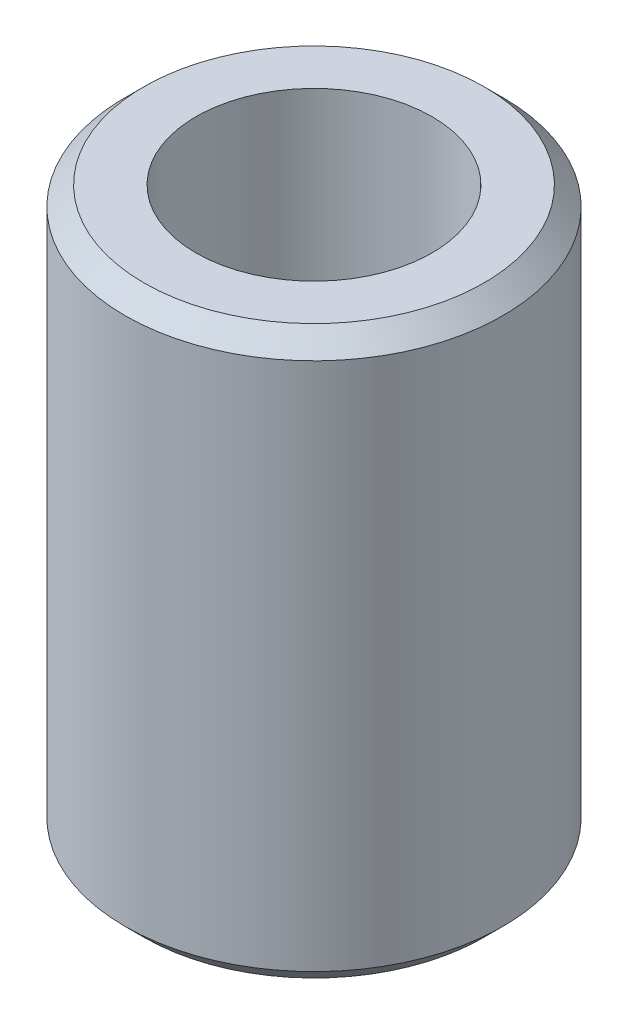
from build123d import *

# Parameters (mm, degrees)
SKETCH1_R           = 20
BOSS_EXTRUDE1_DEPTH = 60
SKETCH2_R           = 12.5
CUT_EXTRUDE1_DEPTH  = 67.332495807
CHAMFER1_SIZE       = 2


with BuildPart() as part:
    # Sketch1 → Boss-Extrude1 (new body)
    with BuildSketch(Plane(origin=(0, 0, 0), x_dir=(1, 0, 0), z_dir=(0, 1, 0))):
        with Locations(Location((0, 0, 0), (0, 0, 270))):
            Circle(SKETCH1_R)
    extrude(amount=BOSS_EXTRUDE1_DEPTH)

    # Sketch2 → Cut-Extrude1 (cut, through all)
    with BuildSketch(Plane(origin=(0, 60, 0), x_dir=(1, 0, 0), z_dir=(0, 1, 0))):
        with Locations(Location((0, 0, 0), (0, 0, 270))):
            Circle(SKETCH2_R)
    extrude(amount=-CUT_EXTRUDE1_DEPTH, mode=Mode.SUBTRACT)

    # Chamfer1
    chamfer1_edges = [part.edges().sort_by_distance(p)[0] for p in [
        (0, 0, -20),
        (0, 60, -20),
    ]]
    chamfer(chamfer1_edges, length=CHAMFER1_SIZE)


solid = part.part
